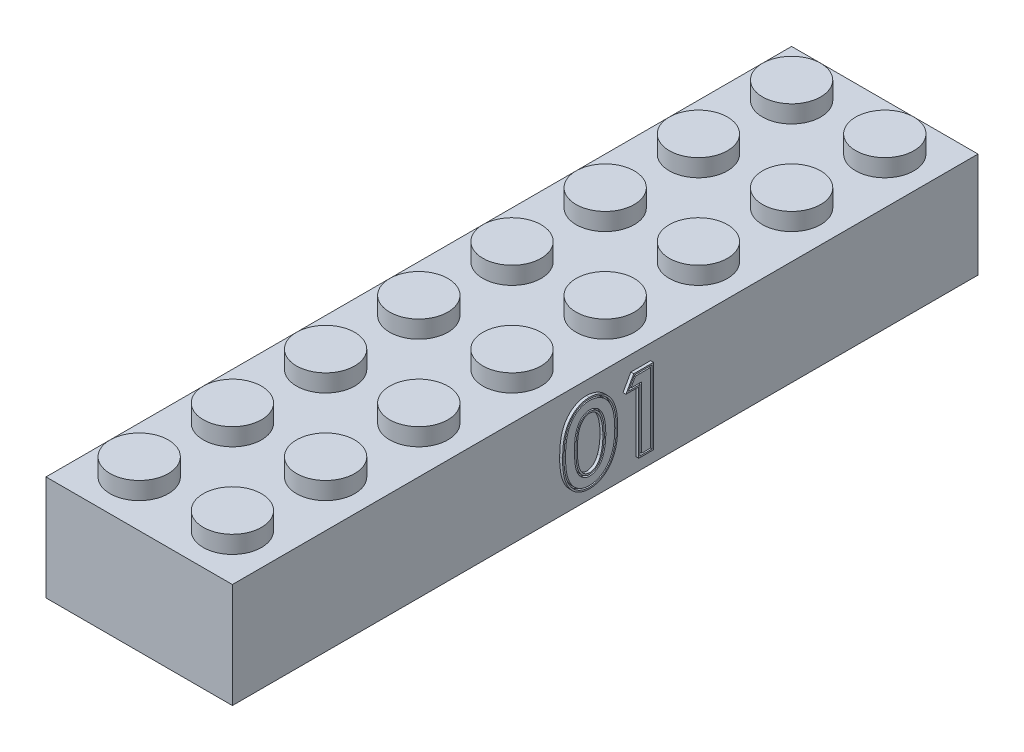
from build123d import *

# Parameters (mm, degrees)
ESQUISSE2_W                = 16
ESQUISSE2_H                = 64
EXTRUSION1_DEPTH           = 1
ESQUISSE3_W                = 16
ESQUISSE3_H                = 64
ESQUISSE3_W_2              = 14
ESQUISSE3_H_2              = 62
EXTRUSION2_DEPTH           = 8
ESQUISSE4_R                = 2.875
ESQUISSE4_R_2              = 2.5
EXTRUSION3_DEPTH           = 8
EXTRUSION4_DEPTH           = 6
R_P_TITION_LIN_AIRE1_COUNT = 7
R_P_TITION_LIN_AIRE1_PITCH = 8
ESQUISSE6_R                = 2.5
EXTRUSION5_DEPTH           = 1.5
R_P_TITION_LIN_AIRE2_COUNT = 8
R_P_TITION_LIN_AIRE2_PITCH = 8
BOSS_EXTRUDE1_DEPTH        = 0.25


with BuildPart() as part:
    # Esquisse2 → Extrusion1 (new body)
    with BuildSketch(Plane(origin=(0, 0, 0), x_dir=(1, 0, 0), z_dir=(0, 1, 0))):
        with Locations((8, -32)):
            Rectangle(ESQUISSE2_W, ESQUISSE2_H)
    extrude(amount=-EXTRUSION1_DEPTH)

    # Esquisse3 → Extrusion2 (add)
    with BuildSketch(Plane.XZ.offset(1)):
        with Locations((8, 32)):
            Rectangle(ESQUISSE3_W, ESQUISSE3_H)
        with Locations((8, 32)):
            Rectangle(ESQUISSE3_W_2, ESQUISSE3_H_2, mode=Mode.SUBTRACT)
    extrude(amount=EXTRUSION2_DEPTH)

    # Esquisse4 → Extrusion3 (add)
    # profile 1 of 7: a face of its own
    with BuildSketch(Plane.XZ.offset(1)):
        with Locations(Location((8, 56, 0), (0, 0, 90))):
            Circle(ESQUISSE4_R)
        with Locations(Location((8, 56, 0), (0, 0, 270))):
            Circle(ESQUISSE4_R_2, mode=Mode.SUBTRACT)
    # profile 2 of 7: a face of its own
    with BuildSketch(Plane.XZ.offset(1)):
        with Locations(Location((7.904548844, 48, 0), (0, 0, 90))):
            Circle(ESQUISSE4_R)
        with Locations(Location((7.904548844, 48, 0), (0, 0, 270))):
            Circle(ESQUISSE4_R_2, mode=Mode.SUBTRACT)
    # profile 3 of 7: a face of its own
    with BuildSketch(Plane.XZ.offset(1)):
        with Locations(Location((7.904548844, 40, 0), (0, 0, 90))):
            Circle(ESQUISSE4_R)
        with Locations(Location((7.904548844, 40, 0), (0, 0, 270))):
            Circle(ESQUISSE4_R_2, mode=Mode.SUBTRACT)
    # profile 4 of 7: a face of its own
    with BuildSketch(Plane.XZ.offset(1)):
        with Locations(Location((7.904548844, 32, 0), (0, 0, 90))):
            Circle(ESQUISSE4_R)
        with Locations(Location((7.904548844, 32, 0), (0, 0, 270))):
            Circle(ESQUISSE4_R_2, mode=Mode.SUBTRACT)
    # profile 5 of 7: a face of its own
    with BuildSketch(Plane.XZ.offset(1)):
        with Locations(Location((7.904548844, 24, 0), (0, 0, 90))):
            Circle(ESQUISSE4_R)
        with Locations(Location((7.904548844, 24, 0), (0, 0, 270))):
            Circle(ESQUISSE4_R_2, mode=Mode.SUBTRACT)
    # profile 6 of 7: a face of its own
    with BuildSketch(Plane.XZ.offset(1)):
        with Locations(Location((7.904548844, 16, 0), (0, 0, 90))):
            Circle(ESQUISSE4_R)
        with Locations(Location((7.904548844, 16, 0), (0, 0, 270))):
            Circle(ESQUISSE4_R_2, mode=Mode.SUBTRACT)
    # profile 7 of 7: a face of its own
    with BuildSketch(Plane.XZ.offset(1)):
        with Locations(Location((7.904548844, 8, 0), (0, 0, 90))):
            Circle(ESQUISSE4_R)
        with Locations(Location((7.904548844, 8, 0), (0, 0, 270))):
            Circle(ESQUISSE4_R_2, mode=Mode.SUBTRACT)
    extrude(amount=EXTRUSION3_DEPTH)

    # Esquisse5 → Extrusion4 (add)
    with BuildSketch(Plane.XZ.offset(1)):
        with BuildLine():
            Line((14.974484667, 56.25), (14.974484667, 55.75))
            Line((14.974484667, 55.75), (10.864109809, 55.75))
            ThreePointArc((10.864109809, 55.75), (10.875, 56), (10.864109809, 56.25))
            Line((10.864109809, 56.25), (14.974484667, 56.25))
        make_face()
        with BuildLine():
            Line((1.047862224, 56.25), (1.047862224, 55.75))
            Line((1.047862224, 55.75), (5.135890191, 55.75))
            ThreePointArc((5.135890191, 55.75), (5.125, 56), (5.135890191, 56.25))
            Line((5.135890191, 56.25), (1.047862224, 56.25))
        make_face()
    extrusion4 = extrude(amount=EXTRUSION4_DEPTH)

    # R_p_tition lin_aire1: Extrusion4 ×7
    with Locations(*[(0, 0, -i * R_P_TITION_LIN_AIRE1_PITCH) for i in range(1, R_P_TITION_LIN_AIRE1_COUNT)]):
        add(extrusion4)

    # Esquisse6 → Extrusion5 (add)
    with BuildSketch(Plane(origin=(0, 0, 0), x_dir=(-1, 0, 0), z_dir=(0, 1, 0))):
        with Locations(Location((-12, 4, 0), (0, 0, 90))):
            Circle(ESQUISSE6_R)
        with Locations(Location((-4, 4, 0), (0, 0, 90))):
            Circle(ESQUISSE6_R)
    extrusion5 = extrude(amount=EXTRUSION5_DEPTH)

    # R_p_tition lin_aire2: Extrusion5 ×8
    with Locations(*[(0, 0, i * R_P_TITION_LIN_AIRE2_PITCH) for i in range(1, R_P_TITION_LIN_AIRE2_COUNT)]):
        add(extrusion5)

    # Sketch1 → Boss-Extrude1 (add)
    # profile 1 of 5: a face of its own
    with BuildSketch(Plane(origin=(16, 0, 0), x_dir=(0, 0, -1), z_dir=(1, 0, 0))):
        with BuildLine():
            add(Edge.make_bspline(
                [(-33.614402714, -7.961599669), (-34.009353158, -7.962838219), (-34.826378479, -7.728762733), (-35.597518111, -6.759180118), (-35.877012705, -5.64575473), (-35.913846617, -4.923442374), (-35.909454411, -4.558714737)],
                knots=[4.8369e-05, 4.8369e-05, 4.8369e-05, 4.8369e-05, 0.249943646, 0.499838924, 0.749734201, 0.999629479, 0.999629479, 0.999629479, 0.999629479], degree=3))
            add(Edge.make_bspline(
                [(-35.909454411, -4.558714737), (-35.909667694, -4.194526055), (-35.88100415, -3.47580315), (-35.601137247, -2.352473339), (-34.828904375, -1.397545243), (-34.007696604, -1.148058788), (-33.610625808, -1.153945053)],
                knots=[0.000375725, 0.000375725, 0.000375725, 0.000375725, 0.250320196, 0.500264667, 0.750209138, 1.000153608, 1.000153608, 1.000153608, 1.000153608], degree=3))
            add(Edge.make_bspline(
                [(-33.610625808, -1.153945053), (-33.211141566, -1.161947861), (-32.389712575, -1.369136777), (-31.552916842, -2.312419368), (-31.214924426, -3.44809214), (-31.182199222, -4.18699492), (-31.178671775, -4.560290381)],
                knots=[-0.000150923, -0.000150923, -0.000150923, -0.000150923, 0.250031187, 0.500213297, 0.750395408, 1.000577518, 1.000577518, 1.000577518, 1.000577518], degree=3))
            add(Edge.make_bspline(
                [(-31.178671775, -4.560290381), (-31.182591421, -4.933268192), (-31.214195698, -5.67153346), (-31.551439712, -6.806577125), (-32.388905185, -7.7452194), (-33.213758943, -7.960998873), (-33.614402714, -7.961599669)],
                knots=[-0.00057804, -0.00057804, -0.00057804, -0.00057804, 0.249554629, 0.499687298, 0.749819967, 0.999952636, 0.999952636, 0.999952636, 0.999952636], degree=3))
        make_face()
        with BuildLine():
            add(Edge.make_bspline(
                [(-31.303677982, -4.56022416), (-31.307526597, -4.926443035), (-31.339090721, -5.656484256), (-31.666995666, -6.747826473), (-32.458624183, -7.633217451), (-33.236707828, -7.836050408), (-33.614692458, -7.836599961)],
                knots=[-0.00028902, -0.00028902, -0.00028902, -0.00028902, 0.249776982, 0.499842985, 0.749908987, 0.999974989, 0.999974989, 0.999974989, 0.999974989], degree=3))
            add(Edge.make_bspline(
                [(-33.614692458, -7.836599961), (-33.985756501, -7.837780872), (-34.752855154, -7.618328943), (-35.479783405, -6.7055726), (-35.752275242, -5.631979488), (-35.788823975, -4.917776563), (-35.784453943, -4.559433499)],
                knots=[2.5553e-05, 2.5553e-05, 2.5553e-05, 2.5553e-05, 0.24997189, 0.499918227, 0.749864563, 0.9998109, 0.9998109, 0.9998109, 0.9998109], degree=3))
            add(Edge.make_bspline(
                [(-35.784453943, -4.559433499), (-35.784686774, -4.201162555), (-35.755910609, -3.488713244), (-35.4846133, -2.407861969), (-34.753333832, -1.506510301), (-33.985106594, -1.273407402), (-33.612804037, -1.278926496)],
                knots=[0.000190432, 0.000190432, 0.000190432, 0.000190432, 0.250162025, 0.500133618, 0.750105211, 1.000076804, 1.000076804, 1.000076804, 1.000076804], degree=3))
            add(Edge.make_bspline(
                [(-33.612804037, -1.278926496), (-33.235357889, -1.286487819), (-32.458859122, -1.481244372), (-31.668433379, -2.371495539), (-31.339841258, -3.463002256), (-31.307141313, -4.193713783), (-31.303677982, -4.56022416)],
                knots=[-7.5461e-05, -7.5461e-05, -7.5461e-05, -7.5461e-05, 0.250015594, 0.500106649, 0.750197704, 1.000288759, 1.000288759, 1.000288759, 1.000288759], degree=3))
        make_face(mode=Mode.SUBTRACT)
    # profile 2 of 5: a face of its own
    with BuildSketch(Plane(origin=(16, 0, 0), x_dir=(0, 0, -1), z_dir=(1, 0, 0))):
        with BuildLine():
            add(Edge.make_bspline(
                [(-33.614982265, -7.711600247), (-33.711033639, -7.711910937), (-33.853818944, -7.702461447), (-34.039729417, -7.666519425), (-34.173884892, -7.629307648), (-34.304909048, -7.582003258), (-34.432232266, -7.524715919), (-34.555018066, -7.455343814), (-34.674438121, -7.377399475), (-34.788758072, -7.288743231), (-34.895239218, -7.188539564), (-34.996441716, -7.079183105), (-35.090360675, -6.959494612), (-35.179071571, -6.830246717), (-35.259043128, -6.69022174), (-35.333602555, -6.540915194), (-35.402728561, -6.381177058), (-35.465142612, -6.208231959), (-35.514924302, -6.018696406), (-35.561864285, -5.814638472), (-35.596325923, -5.593994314), (-35.626164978, -5.358426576), (-35.650280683, -5.012053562), (-35.661728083, -4.744275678), (-35.659453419, -4.56015794)],
                knots=[0, 0, 0, 0, 0.068176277, 0.101187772, 0.134229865, 0.166878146, 0.199963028, 0.23318568, 0.266859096, 0.301097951, 0.335699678, 0.370509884, 0.406744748, 0.443573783, 0.481662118, 0.521080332, 0.561961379, 0.605128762, 0.651412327, 0.700940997, 0.753667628, 0.809812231, 0.869410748, 1, 1, 1, 1], degree=3))
            add(Edge.make_bspline(
                [(-35.659453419, -4.56015794), (-35.659585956, -4.375002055), (-35.653655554, -4.105229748), (-35.62509489, -3.757279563), (-35.598561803, -3.520910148), (-35.561820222, -3.300898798), (-35.519787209, -3.097137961), (-35.468044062, -2.909602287), (-35.407606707, -2.737957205), (-35.339747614, -2.579154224), (-35.265136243, -2.431204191), (-35.184245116, -2.292228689), (-35.097620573, -2.16227612), (-35.001167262, -2.044241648), (-34.90054765, -1.934082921), (-34.791983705, -1.833950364), (-34.676470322, -1.744345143), (-34.556977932, -1.663333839), (-34.432093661, -1.595050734), (-34.304710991, -1.535574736), (-34.173206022, -1.487445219), (-34.038530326, -1.450126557), (-33.852912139, -1.414812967), (-33.710810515, -1.402487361), (-33.614982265, -1.40390794)],
                knots=[0, 0, 0, 0, 0.131292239, 0.191134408, 0.247469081, 0.299860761, 0.349217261, 0.394905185, 0.437665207, 0.478130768, 0.517254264, 0.555057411, 0.59208323, 0.6278365, 0.663011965, 0.697786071, 0.732388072, 0.766577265, 0.800013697, 0.833182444, 0.866160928, 0.899168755, 0.932146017, 1, 1, 1, 1], degree=3))
            add(Edge.make_bspline(
                [(-33.614982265, -1.40390794), (-33.511546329, -1.405980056), (-33.356573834, -1.412413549), (-33.156367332, -1.452891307), (-33.010836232, -1.490509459), (-32.870774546, -1.541955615), (-32.733414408, -1.601111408), (-32.602981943, -1.676039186), (-32.475028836, -1.757999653), (-32.353942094, -1.852516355), (-32.238127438, -1.955215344), (-32.131195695, -2.069602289), (-32.029249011, -2.191741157), (-31.937516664, -2.326415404), (-31.850190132, -2.468909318), (-31.772868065, -2.622771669), (-31.699506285, -2.785280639), (-31.636447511, -2.960757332), (-31.579373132, -3.148199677), (-31.533121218, -3.349942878), (-31.494751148, -3.565360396), (-31.465191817, -3.79481313), (-31.43523402, -4.12758682), (-31.430342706, -4.38464373), (-31.428684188, -4.56015794)],
                knots=[0, 0, 0, 0, 0.071966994, 0.10709435, 0.141635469, 0.176209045, 0.210576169, 0.245316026, 0.280492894, 0.315985, 0.351831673, 0.387834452, 0.424584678, 0.462157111, 0.5008403, 0.540519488, 0.581607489, 0.62454495, 0.669858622, 0.717555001, 0.768128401, 0.821703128, 0.87810671, 1, 1, 1, 1], degree=3))
            add(Edge.make_bspline(
                [(-31.428684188, -4.56015794), (-31.430520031, -4.734849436), (-31.43490218, -4.990769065), (-31.46562596, -5.321795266), (-31.493203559, -5.55023696), (-31.531895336, -5.764805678), (-31.579004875, -5.965612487), (-31.631834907, -6.153713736), (-31.696416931, -6.327460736), (-31.76792798, -6.489777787), (-31.845512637, -6.642264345), (-31.930959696, -6.785220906), (-32.025571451, -6.917096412), (-32.124839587, -7.042040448), (-32.233076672, -7.155710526), (-32.348310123, -7.260273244), (-32.470261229, -7.354397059), (-32.597534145, -7.439277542), (-32.730927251, -7.510927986), (-32.867078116, -7.574520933), (-33.009026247, -7.622729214), (-33.153895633, -7.663816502), (-33.355902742, -7.699772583), (-33.510804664, -7.711454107), (-33.614982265, -7.711600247)],
                knots=[0, 0, 0, 0, 0.121432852, 0.177603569, 0.23090887, 0.281248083, 0.328981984, 0.374173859, 0.41688378, 0.457636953, 0.497347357, 0.53567886, 0.573212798, 0.610031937, 0.64645653, 0.682124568, 0.718035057, 0.753392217, 0.788268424, 0.823144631, 0.857652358, 0.892293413, 0.927670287, 1, 1, 1, 1], degree=3))
        make_face()
        with BuildLine():
            add(Edge.make_bspline(
                [(-33.596953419, -2.096215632), (-33.705880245, -2.095112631), (-33.871315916, -2.128999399), (-34.078576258, -2.226559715), (-34.206025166, -2.311255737), (-34.305329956, -2.392291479), (-34.376483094, -2.463661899), (-34.442219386, -2.543624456), (-34.505657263, -2.630648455), (-34.563583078, -2.726892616), (-34.619844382, -2.830600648), (-34.669414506, -2.943486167), (-34.716032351, -3.065149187), (-34.757091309, -3.198816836), (-34.79259898, -3.347004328), (-34.824328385, -3.510471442), (-34.84719972, -3.69002884), (-34.866408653, -3.884819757), (-34.886373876, -4.175595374), (-34.890458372, -4.401864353), (-34.89022265, -4.557754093)],
                knots=[0, 0, 0, 0, 0.105358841, 0.161616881, 0.221760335, 0.253562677, 0.286046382, 0.319493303, 0.35406988, 0.390592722, 0.428562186, 0.468644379, 0.510291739, 0.555115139, 0.604404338, 0.658309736, 0.716837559, 0.780213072, 0.848502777, 1, 1, 1, 1], degree=3))
            add(Edge.make_bspline(
                [(-34.89022265, -4.557754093), (-34.891012, -4.713674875), (-34.885383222, -4.939430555), (-34.867771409, -5.229911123), (-34.848879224, -5.424406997), (-34.823652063, -5.60360265), (-34.793800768, -5.767250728), (-34.759764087, -5.915664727), (-34.718268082, -6.049088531), (-34.672321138, -6.170658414), (-34.621234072, -6.282578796), (-34.568188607, -6.387385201), (-34.508434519, -6.483000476), (-34.445153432, -6.57073062), (-34.37720281, -6.650243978), (-34.3070079, -6.723275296), (-34.20687539, -6.804398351), (-34.07856392, -6.889025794), (-33.870655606, -6.985831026), (-33.705642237, -7.020869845), (-33.596953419, -7.019292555)],
                knots=[0, 0, 0, 0, 0.151447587, 0.219300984, 0.282655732, 0.341217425, 0.39503344, 0.444215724, 0.489024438, 0.530658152, 0.570372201, 0.608492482, 0.644672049, 0.679780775, 0.713467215, 0.746216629, 0.778008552, 0.83845766, 0.895050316, 1, 1, 1, 1], degree=3))
            add(Edge.make_bspline(
                [(-33.596953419, -7.019292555), (-33.476038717, -7.018176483), (-33.292199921, -6.989232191), (-33.065615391, -6.886076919), (-32.930085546, -6.798681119), (-32.827683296, -6.713556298), (-32.75373069, -6.64110586), (-32.68556836, -6.560215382), (-32.621217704, -6.472122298), (-32.563044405, -6.375382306), (-32.486648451, -6.234976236), (-32.443126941, -6.120316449), (-32.415463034, -6.042129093)],
                knots=[0, 0, 0, 0, 0.221290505, 0.334387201, 0.453015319, 0.514900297, 0.577560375, 0.641980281, 0.708044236, 0.776746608, 0.848170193, 1, 1, 1, 1], degree=3))
            add(Edge.make_bspline(
                [(-32.415463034, -6.042129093), (-32.378841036, -5.935929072), (-32.329724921, -5.771047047), (-32.281858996, -5.542778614), (-32.250257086, -5.361263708), (-32.226311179, -5.171560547), (-32.203737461, -4.903174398), (-32.198656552, -4.697236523), (-32.197914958, -4.557754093)],
                knots=[0, 0, 0, 0, 0.223635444, 0.341877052, 0.464062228, 0.590271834, 0.722321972, 1, 1, 1, 1], degree=3))
            add(Edge.make_bspline(
                [(-32.197914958, -4.557754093), (-32.19608937, -4.419379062), (-32.204289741, -4.216930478), (-32.222374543, -3.953562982), (-32.244885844, -3.771335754), (-32.270131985, -3.598571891), (-32.30474544, -3.436491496), (-32.341873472, -3.283476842), (-32.388256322, -3.141417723), (-32.438966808, -3.008881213), (-32.49245176, -2.885426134), (-32.550282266, -2.770953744), (-32.613997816, -2.666900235), (-32.681247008, -2.571549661), (-32.7522808, -2.485473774), (-32.828157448, -2.409163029), (-32.934236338, -2.3231), (-33.070980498, -2.233663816), (-33.295692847, -2.127448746), (-33.477888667, -2.097215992), (-33.596953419, -2.096215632)],
                knots=[0, 0, 0, 0, 0.131948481, 0.193277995, 0.251783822, 0.307086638, 0.359786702, 0.409847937, 0.45723286, 0.502239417, 0.545203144, 0.585546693, 0.624486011, 0.661499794, 0.696785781, 0.730841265, 0.763974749, 0.826949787, 0.886296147, 1, 1, 1, 1], degree=3))
        make_face(mode=Mode.SUBTRACT)
    # profile 3 of 5: a face of its own
    with BuildSketch(Plane(origin=(16, 0, 0), x_dir=(0, 0, -1), z_dir=(1, 0, 0))):
        with BuildLine():
            add(Edge.make_bspline(
                [(-32.533471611, -6.000907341), (-32.374923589, -5.540939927), (-32.325497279, -5.04311636), (-32.322910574, -4.556597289)],
                knots=[0.000341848, 0.000341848, 0.000341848, 0.000341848, 1.000326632, 1.000326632, 1.000326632, 1.000326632], degree=3))
            add(Edge.make_bspline(
                [(-32.322910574, -4.556597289), (-32.319536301, -4.300835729), (-32.347664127, -3.785648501), (-32.518372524, -3.042794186), (-32.90170286, -2.408936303), (-33.368326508, -2.223140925), (-33.598111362, -2.221210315)],
                knots=[-0.000156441, -0.000156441, -0.000156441, -0.000156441, 0.249891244, 0.49993893, 0.749986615, 1.0000343, 1.0000343, 1.0000343, 1.0000343], degree=3))
            add(Edge.make_bspline(
                [(-33.598111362, -2.221210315), (-33.820308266, -2.218960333), (-34.26294612, -2.425689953), (-34.625422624, -3.058141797), (-34.748296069, -3.794633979), (-34.765604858, -4.304894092), (-34.765222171, -4.557975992)],
                knots=[-3.4741e-05, -3.4741e-05, -3.4741e-05, -3.4741e-05, 0.250007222, 0.500049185, 0.750091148, 1.000133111, 1.000133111, 1.000133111, 1.000133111], degree=3))
            add(Edge.make_bspline(
                [(-34.765222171, -4.557975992), (-34.766503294, -4.811036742), (-34.749506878, -5.32109919), (-34.627661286, -6.058614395), (-34.262683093, -6.690622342), (-33.820484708, -6.897523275), (-33.598437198, -6.894300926)],
                knots=[-0.000133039, -0.000133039, -0.000133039, -0.000133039, 0.249926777, 0.499986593, 0.750046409, 1.000106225, 1.000106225, 1.000106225, 1.000106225], degree=3))
            add(Edge.make_bspline(
                [(-33.598437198, -6.894300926), (-33.359262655, -6.892093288), (-32.8709463, -6.705730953), (-32.616596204, -6.235774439), (-32.533471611, -6.000907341)],
                knots=[-0.000201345, -0.000201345, -0.000201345, -0.000201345, 0.499742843, 0.99968703, 0.99968703, 0.99968703, 0.99968703], degree=3))
        make_face()
        with BuildLine():
            add(Edge.make_bspline(
                [(-32.44790619, -4.555440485), (-32.441467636, -4.06741401), (-32.523346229, -3.274792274), (-32.989328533, -2.510539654), (-33.396859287, -2.347905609), (-33.599269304, -2.346204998)],
                knots=[-0.000312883, -0.000312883, -0.000312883, -0.000312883, 0.499877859, 0.74997323, 1.000068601, 1.000068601, 1.000068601, 1.000068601], degree=3))
            add(Edge.make_bspline(
                [(-33.599269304, -2.346204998), (-33.791627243, -2.344257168), (-34.167922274, -2.521648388), (-34.504296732, -3.09626589), (-34.623259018, -3.803258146), (-34.640598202, -4.309201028), (-34.640221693, -4.558197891)],
                knots=[-6.9481e-05, -6.9481e-05, -6.9481e-05, -6.9481e-05, 0.250014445, 0.500098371, 0.750182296, 1.000266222, 1.000266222, 1.000266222, 1.000266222], degree=3))
            add(Edge.make_bspline(
                [(-34.640221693, -4.558197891), (-34.641481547, -4.807057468), (-34.625261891, -5.312660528), (-34.503729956, -6.019915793), (-34.232044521, -6.501507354), (-33.870786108, -6.72454541), (-33.692673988, -6.770655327), (-33.599920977, -6.769309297)],
                knots=[-0.000266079, -0.000266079, -0.000266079, -0.000266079, 0.249853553, 0.499973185, 0.750092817, 0.875152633, 1.000212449, 1.000212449, 1.000212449, 1.000212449], degree=3))
            add(Edge.make_bspline(
                [(-33.599920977, -6.769309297), (-33.389518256, -6.767367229), (-33.067557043, -6.638919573), (-32.792287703, -6.301160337), (-32.691458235, -6.072606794), (-32.65148101, -5.959687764)],
                knots=[-0.000402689, -0.000402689, -0.000402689, -0.000402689, 0.499477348, 0.749417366, 0.999357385, 0.999357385, 0.999357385, 0.999357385], degree=3))
            add(Edge.make_bspline(
                [(-32.65148101, -5.959687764), (-32.497410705, -5.512509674), (-32.450420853, -5.028409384), (-32.44790619, -4.555440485)],
                knots=[0.000705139, 0.000705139, 0.000705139, 0.000705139, 1.000653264, 1.000653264, 1.000653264, 1.000653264], degree=3))
        make_face(mode=Mode.SUBTRACT)
    # profile 4 of 5: a face of its own
    with BuildSketch(Plane(origin=(16, 0, 0), x_dir=(0, 0, -1), z_dir=(1, 0, 0))):
        Polygon((-28.101761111, -7.807754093), (-29.370991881, -7.807754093), (-29.370991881, -2.500061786), (-30.470238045, -2.500061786), (-29.803704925, -1.307754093), (-28.101761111, -1.307754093), align=None)
        Polygon((-29.245991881, -7.682754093), (-29.245991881, -2.375061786), (-30.257153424, -2.375061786), (-29.730377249, -1.432754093), (-28.226761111, -1.432754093), (-28.226761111, -7.682754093), align=None, mode=Mode.SUBTRACT)
    # profile 5 of 5: a face of its own
    with BuildSketch(Plane(origin=(16, 0, 0), x_dir=(0, 0, -1), z_dir=(1, 0, 0))):
        Polygon((-30.044068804, -2.250061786), (-29.657049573, -1.557754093), (-28.351761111, -1.557754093), (-28.351761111, -7.557754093), (-29.120991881, -7.557754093), (-29.120991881, -2.250061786), align=None)
    extrude(amount=BOSS_EXTRUDE1_DEPTH)


solid = part.part
